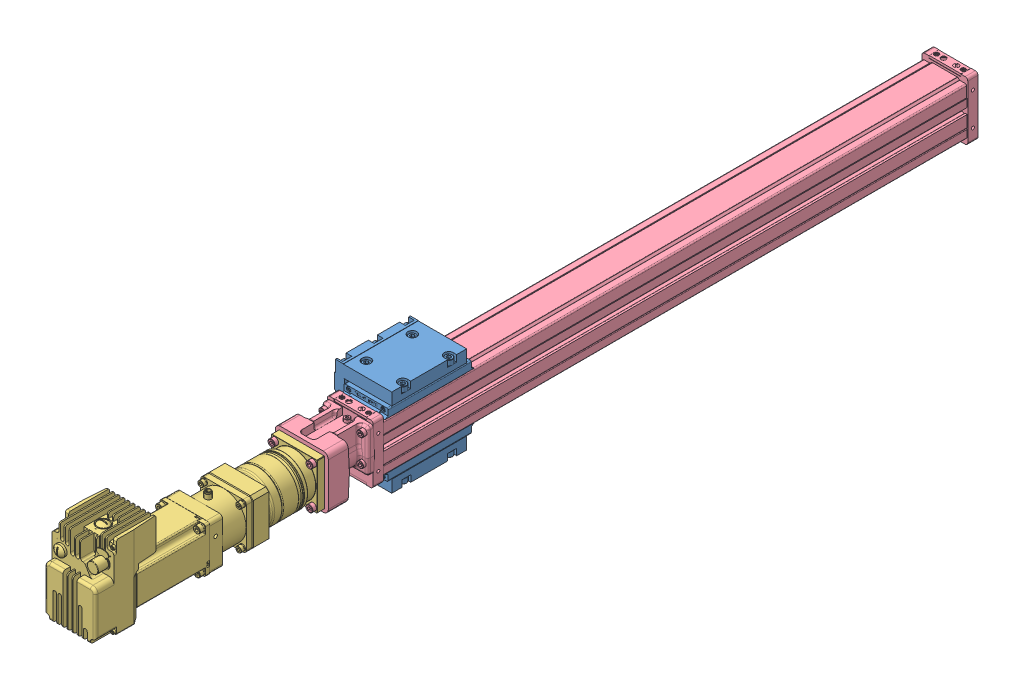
SolidWorks assembly B3S_10.SLDASM, configuration Default (file format 11000). Lengths in mm.
Overall size (77.08 126.17 1101).
4 component instances, 4 part files, 3 mates.
Components (placement in the parent):
- 34109330_B3S10_BN08_SK64.200_LMI_AMI2C1B2_B3S-377684-1-1: 34109330_B3S10_BN08_SK64.200_LMI_AMI2C1B2_B3S-377684-1.sldprt [Default] at (0 23.6304 -58.6994) x (-1 0 0) z (0 0 -1) size (71.44 109.47 111.06)
- tempJoin7_45109053_B3S10_BN08_SK64.200_LMI_AMI2C1B2_B3S-377684-1-1: tempJoin7_45109053_B3S10_BN08_SK64.200_LMI_AMI2C1B2_B3S-377684-1.sldprt [Default] at origin size (34.04 34.04 35.56)
- 36049745_B3S10_BN08_SK64.200_LMI_AMI2C1B2_B3S-377684-1-1: 36049745_B3S10_BN08_SK64.200_LMI_AMI2C1B2_B3S-377684-1.sldprt [Default] at (0 0 72.9488) x (-1 0 0) z (0 0 -1) size (64.79 102.82 320.1)
- Base_B3S10_BN08_SK64.200_LMI_AMI2C1B2_B3S-377684-1-1: Base_B3S10_BN08_SK64.200_LMI_AMI2C1B2_B3S-377684-1.sldprt [Default] at origin size (66.04 75.93 827.17)
Mates (geometry in assembly coordinates):
- Distance1: distance = 16.8059 mm: plane of 34109330_B3S10_BN08_SK64.200_LMI_AMI2C1B2_B3S-377684-1-1 through (-44.0563 54.5052 -105.3084) normal (-1 0 0); plane of Base_B3S10_BN08_SK64.200_LMI_AMI2C1B2_B3S-377684-1-1 through (-27.2504 26.7462 -1748.0788) normal (-1 0 0)
- Distance2: distance = 23.7251 mm: plane of 34109330_B3S10_BN08_SK64.200_LMI_AMI2C1B2_B3S-377684-1-1 through (26.8605 54.1289 -12.0904) normal (0 1 0); plane of Base_B3S10_BN08_SK64.200_LMI_AMI2C1B2_B3S-377684-1-1 through (-15.3813 30.4038 -1822.8839) normal (0 1 0)
- LimitDistance1: limit distance = 12.0904 mm: plane of 34109330_B3S10_BN08_SK64.200_LMI_AMI2C1B2_B3S-377684-1-1 through (-32.1437 54.5052 -12.0904) normal (0 0 1); plane of Base_B3S10_BN08_SK64.200_LMI_AMI2C1B2_B3S-377684-1-1 through (-28.575 -37.1094 0) normal (0 0 -1)
